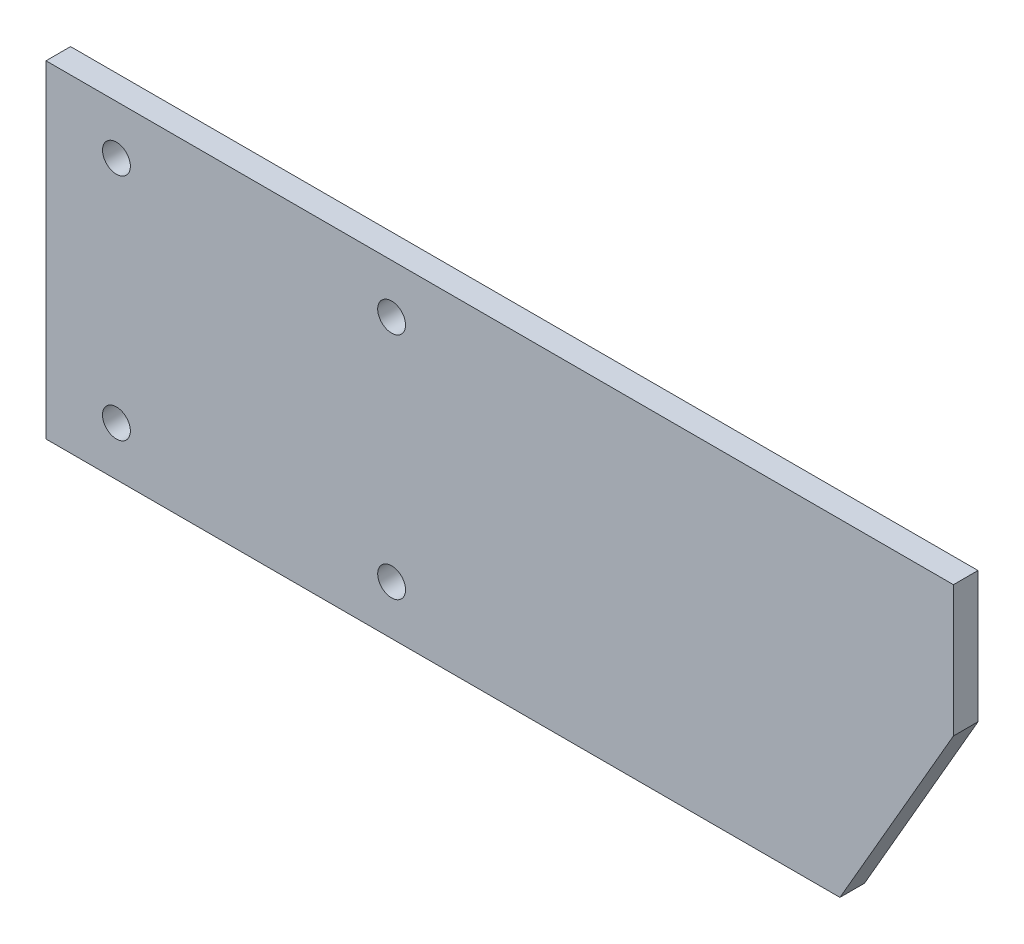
from build123d import *

# Parameters (mm, degrees)
SKETCH1_R      = 8.5
EXTRUDE1_DEPTH = 15


with BuildPart() as part:
    # Sketch1 → Extrude1 (new body)
    with BuildSketch(Plane.XY):
        Polygon((-127, 100), (427, 100), (427, 20), (357.717967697, -100), (-127, -100), align=None)
        with Locations((-84, 70)):
            Circle(SKETCH1_R, mode=Mode.SUBTRACT)
        with Locations((84, 70)):
            Circle(SKETCH1_R, mode=Mode.SUBTRACT)
        with Locations((84, -70)):
            Circle(SKETCH1_R, mode=Mode.SUBTRACT)
        with Locations((-84, -70)):
            Circle(SKETCH1_R, mode=Mode.SUBTRACT)
    extrude(amount=EXTRUDE1_DEPTH)


solid = part.part
